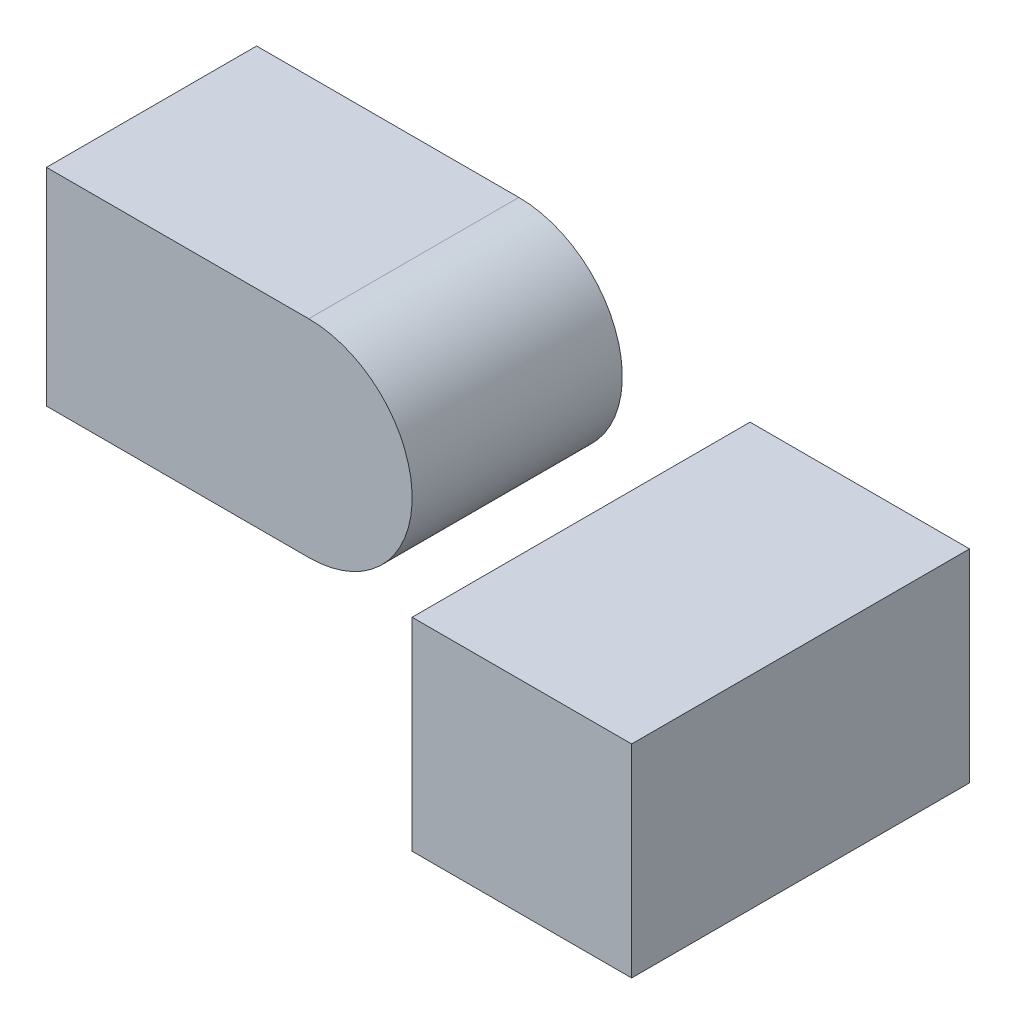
ISO-10303-21;
HEADER;
FILE_DESCRIPTION(('STEP AP214'),'2;1');
FILE_NAME('part.step','',(''),(''),'','','');
FILE_SCHEMA(('AUTOMOTIVE_DESIGN { 1 0 10303 214 1 1 1 1 }'));
ENDSEC;
DATA;
#1=APPLICATION_CONTEXT('core data for automotive mechanical design processes');
#2=APPLICATION_PROTOCOL_DEFINITION('international standard','automotive_design',2000,#1);
#3=PRODUCT_CONTEXT('',#1,'mechanical');
#4=PRODUCT('Part','Part','',(#3));
#5=PRODUCT_RELATED_PRODUCT_CATEGORY('part','',(#4));
#6=PRODUCT_DEFINITION_FORMATION('','',#4);
#7=PRODUCT_DEFINITION_CONTEXT('part definition',#1,'design');
#8=PRODUCT_DEFINITION('design','',#6,#7);
#9=PRODUCT_DEFINITION_SHAPE('','',#8);
#10=(LENGTH_UNIT() NAMED_UNIT(*) SI_UNIT(.MILLI.,.METRE.));
#11=(NAMED_UNIT(*) PLANE_ANGLE_UNIT() SI_UNIT($,.RADIAN.));
#12=(NAMED_UNIT(*) SI_UNIT($,.STERADIAN.) SOLID_ANGLE_UNIT());
#13=UNCERTAINTY_MEASURE_WITH_UNIT(LENGTH_MEASURE(1.E-05),#10,'distance_accuracy_value','');
#14=(GEOMETRIC_REPRESENTATION_CONTEXT(3) GLOBAL_UNCERTAINTY_ASSIGNED_CONTEXT((#13)) GLOBAL_UNIT_ASSIGNED_CONTEXT((#10,
#11,#12)) REPRESENTATION_CONTEXT('',''));
#15=CARTESIAN_POINT('',(0.,0.,0.));
#16=DIRECTION('',(0.,0.,1.));
#17=DIRECTION('',(1.,0.,0.));
#18=AXIS2_PLACEMENT_3D('',#15,#16,#17);
#19=CARTESIAN_POINT('',(88.7379145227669,0.,-31.));
#20=DIRECTION('',(-1.,0.,0.));
#21=DIRECTION('',(0.,0.,1.));
#22=AXIS2_PLACEMENT_3D('',#19,#20,#21);
#23=PLANE('',#22);
#24=DIRECTION('',(0.,-1.,0.));
#25=VECTOR('',#24,1.);
#26=CARTESIAN_POINT('',(88.7379145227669,0.,51.));
#27=LINE('',#26,#25);
#28=CARTESIAN_POINT('',(88.7379145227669,0.,51.));
#29=VERTEX_POINT('',#28);
#30=CARTESIAN_POINT('',(88.7379145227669,-49.1849191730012,51.));
#31=VERTEX_POINT('',#30);
#32=EDGE_CURVE('E107',#29,#31,#27,.T.);
#33=ORIENTED_EDGE('',*,*,#32,.F.);
#34=DIRECTION('',(0.,0.,1.));
#35=VECTOR('',#34,1.);
#36=CARTESIAN_POINT('',(88.7379145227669,0.,-31.));
#37=LINE('',#36,#35);
#38=CARTESIAN_POINT('',(88.7379145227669,0.,-31.));
#39=VERTEX_POINT('',#38);
#40=EDGE_CURVE('E12',#39,#29,#37,.T.);
#41=ORIENTED_EDGE('',*,*,#40,.F.);
#42=DIRECTION('',(0.,-1.,0.));
#43=VECTOR('',#42,1.);
#44=CARTESIAN_POINT('',(88.7379145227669,0.,-31.));
#45=LINE('',#44,#43);
#46=CARTESIAN_POINT('',(88.7379145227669,-49.1849191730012,-31.));
#47=VERTEX_POINT('',#46);
#48=EDGE_CURVE('E101',#39,#47,#45,.T.);
#49=ORIENTED_EDGE('',*,*,#48,.T.);
#50=DIRECTION('',(0.,0.,1.));
#51=VECTOR('',#50,1.);
#52=CARTESIAN_POINT('',(88.7379145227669,-49.1849191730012,-31.));
#53=LINE('',#52,#51);
#54=EDGE_CURVE('E46',#47,#31,#53,.T.);
#55=ORIENTED_EDGE('',*,*,#54,.T.);
#56=EDGE_LOOP('',(#33,#41,#49,#55));
#57=FACE_BOUND('',#56,.T.);
#58=ADVANCED_FACE('F43',(#57),#23,.T.);
#59=CARTESIAN_POINT('',(88.7379145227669,0.,-31.));
#60=DIRECTION('',(0.,1.,0.));
#61=DIRECTION('',(0.,0.,1.));
#62=AXIS2_PLACEMENT_3D('',#59,#60,#61);
#63=PLANE('',#62);
#64=DIRECTION('',(-1.,0.,0.));
#65=VECTOR('',#64,1.);
#66=CARTESIAN_POINT('',(88.7379145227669,0.,51.));
#67=LINE('',#66,#65);
#68=CARTESIAN_POINT('',(142.00653326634,0.,51.));
#69=VERTEX_POINT('',#68);
#70=EDGE_CURVE('E103',#69,#29,#67,.T.);
#71=ORIENTED_EDGE('',*,*,#70,.F.);
#72=DIRECTION('',(0.,0.,1.));
#73=VECTOR('',#72,1.);
#74=CARTESIAN_POINT('',(142.00653326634,0.,-31.));
#75=LINE('',#74,#73);
#76=CARTESIAN_POINT('',(142.00653326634,0.,-31.));
#77=VERTEX_POINT('',#76);
#78=EDGE_CURVE('E52',#77,#69,#75,.T.);
#79=ORIENTED_EDGE('',*,*,#78,.F.);
#80=DIRECTION('',(-1.,0.,0.));
#81=VECTOR('',#80,1.);
#82=CARTESIAN_POINT('',(88.7379145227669,0.,-31.));
#83=LINE('',#82,#81);
#84=EDGE_CURVE('E98',#77,#39,#83,.T.);
#85=ORIENTED_EDGE('',*,*,#84,.T.);
#86=ORIENTED_EDGE('',*,*,#40,.T.);
#87=EDGE_LOOP('',(#71,#79,#85,#86));
#88=FACE_BOUND('',#87,.T.);
#89=ADVANCED_FACE('F117',(#88),#63,.T.);
#90=CARTESIAN_POINT('',(142.00653326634,0.,-31.));
#91=DIRECTION('',(1.,0.,0.));
#92=DIRECTION('',(0.,0.,-1.));
#93=AXIS2_PLACEMENT_3D('',#90,#91,#92);
#94=PLANE('',#93);
#95=DIRECTION('',(0.,1.,0.));
#96=VECTOR('',#95,1.);
#97=CARTESIAN_POINT('',(142.00653326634,0.,51.));
#98=LINE('',#97,#96);
#99=CARTESIAN_POINT('',(142.00653326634,-49.1849191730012,51.));
#100=VERTEX_POINT('',#99);
#101=EDGE_CURVE('E93',#100,#69,#98,.T.);
#102=ORIENTED_EDGE('',*,*,#101,.F.);
#103=DIRECTION('',(0.,0.,1.));
#104=VECTOR('',#103,1.);
#105=CARTESIAN_POINT('',(142.00653326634,-49.1849191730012,-31.));
#106=LINE('',#105,#104);
#107=CARTESIAN_POINT('',(142.00653326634,-49.1849191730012,-31.));
#108=VERTEX_POINT('',#107);
#109=EDGE_CURVE('E88',#108,#100,#106,.T.);
#110=ORIENTED_EDGE('',*,*,#109,.F.);
#111=DIRECTION('',(0.,1.,0.));
#112=VECTOR('',#111,1.);
#113=CARTESIAN_POINT('',(142.00653326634,0.,-31.));
#114=LINE('',#113,#112);
#115=EDGE_CURVE('E91',#108,#77,#114,.T.);
#116=ORIENTED_EDGE('',*,*,#115,.T.);
#117=ORIENTED_EDGE('',*,*,#78,.T.);
#118=EDGE_LOOP('',(#102,#110,#116,#117));
#119=FACE_BOUND('',#118,.T.);
#120=ADVANCED_FACE('F90',(#119),#94,.T.);
#121=CARTESIAN_POINT('',(88.7379145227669,-49.1849191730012,-31.));
#122=DIRECTION('',(0.,-1.,0.));
#123=DIRECTION('',(0.,0.,-1.));
#124=AXIS2_PLACEMENT_3D('',#121,#122,#123);
#125=PLANE('',#124);
#126=DIRECTION('',(1.,0.,0.));
#127=VECTOR('',#126,1.);
#128=CARTESIAN_POINT('',(88.7379145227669,-49.1849191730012,51.));
#129=LINE('',#128,#127);
#130=EDGE_CURVE('E110',#31,#100,#129,.T.);
#131=ORIENTED_EDGE('',*,*,#130,.F.);
#132=ORIENTED_EDGE('',*,*,#54,.F.);
#133=DIRECTION('',(1.,0.,0.));
#134=VECTOR('',#133,1.);
#135=CARTESIAN_POINT('',(88.7379145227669,-49.1849191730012,-31.));
#136=LINE('',#135,#134);
#137=EDGE_CURVE('E97',#47,#108,#136,.T.);
#138=ORIENTED_EDGE('',*,*,#137,.T.);
#139=ORIENTED_EDGE('',*,*,#109,.T.);
#140=EDGE_LOOP('',(#131,#132,#138,#139));
#141=FACE_BOUND('',#140,.T.);
#142=ADVANCED_FACE('F100',(#141),#125,.T.);
#143=CARTESIAN_POINT('',(88.7379145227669,-49.1849191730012,-31.));
#144=DIRECTION('',(0.,0.,1.));
#145=DIRECTION('',(1.,0.,0.));
#146=AXIS2_PLACEMENT_3D('',#143,#144,#145);
#147=PLANE('',#146);
#148=ORIENTED_EDGE('',*,*,#48,.F.);
#149=ORIENTED_EDGE('',*,*,#84,.F.);
#150=ORIENTED_EDGE('',*,*,#115,.F.);
#151=ORIENTED_EDGE('',*,*,#137,.F.);
#152=EDGE_LOOP('',(#148,#149,#150,#151));
#153=FACE_BOUND('',#152,.T.);
#154=ADVANCED_FACE('F96',(#153),#147,.F.);
#155=CARTESIAN_POINT('',(88.7379145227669,-49.1849191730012,51.));
#156=DIRECTION('',(0.,0.,1.));
#157=DIRECTION('',(1.,0.,0.));
#158=AXIS2_PLACEMENT_3D('',#155,#156,#157);
#159=PLANE('',#158);
#160=ORIENTED_EDGE('',*,*,#32,.T.);
#161=ORIENTED_EDGE('',*,*,#130,.T.);
#162=ORIENTED_EDGE('',*,*,#101,.T.);
#163=ORIENTED_EDGE('',*,*,#70,.T.);
#164=EDGE_LOOP('',(#160,#161,#162,#163));
#165=FACE_BOUND('',#164,.T.);
#166=ADVANCED_FACE('F116',(#165),#159,.T.);
#167=CLOSED_SHELL('',(#58,#89,#120,#142,#154,#166));
#168=MANIFOLD_SOLID_BREP('B2',#167);
#169=CARTESIAN_POINT('',(63.6471336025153,25.0907809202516,51.));
#170=DIRECTION('',(0.,0.,-1.));
#171=DIRECTION('',(-1.,0.,0.));
#172=AXIS2_PLACEMENT_3D('',#169,#170,#171);
#173=CYLINDRICAL_SURFACE('',#172,25.0907809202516);
#174=DIRECTION('',(0.,0.,-1.));
#175=VECTOR('',#174,1.);
#176=CARTESIAN_POINT('',(63.6471336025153,50.1815618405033,51.));
#177=LINE('',#176,#175);
#178=CARTESIAN_POINT('',(63.6471336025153,50.1815618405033,51.));
#179=VERTEX_POINT('',#178);
#180=CARTESIAN_POINT('',(63.6471336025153,50.1815618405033,0.));
#181=VERTEX_POINT('',#180);
#182=EDGE_CURVE('E227',#179,#181,#177,.T.);
#183=ORIENTED_EDGE('',*,*,#182,.F.);
#184=CARTESIAN_POINT('',(63.6471336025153,25.0907809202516,51.));
#185=DIRECTION('',(0.,0.,-1.));
#186=DIRECTION('',(-1.,0.,0.));
#187=AXIS2_PLACEMENT_3D('',#184,#185,#186);
#188=CIRCLE('',#187,25.0907809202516);
#189=CARTESIAN_POINT('',(63.6471336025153,0.,51.));
#190=VERTEX_POINT('',#189);
#191=EDGE_CURVE('E174',#190,#179,#188,.F.);
#192=ORIENTED_EDGE('',*,*,#191,.F.);
#193=DIRECTION('',(0.,0.,-1.));
#194=VECTOR('',#193,1.);
#195=CARTESIAN_POINT('',(63.6471336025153,0.,51.));
#196=LINE('',#195,#194);
#197=CARTESIAN_POINT('',(63.6471336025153,0.,0.));
#198=VERTEX_POINT('',#197);
#199=EDGE_CURVE('E211',#198,#190,#196,.F.);
#200=ORIENTED_EDGE('',*,*,#199,.F.);
#201=CARTESIAN_POINT('',(63.6471336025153,25.0907809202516,0.));
#202=DIRECTION('',(0.,0.,-1.));
#203=DIRECTION('',(-1.,0.,0.));
#204=AXIS2_PLACEMENT_3D('',#201,#202,#203);
#205=CIRCLE('',#204,25.0907809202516);
#206=EDGE_CURVE('E41',#181,#198,#205,.T.);
#207=ORIENTED_EDGE('',*,*,#206,.F.);
#208=EDGE_LOOP('',(#183,#192,#200,#207));
#209=FACE_BOUND('',#208,.T.);
#210=ADVANCED_FACE('F167',(#209),#173,.T.);
#211=CARTESIAN_POINT('',(0.,0.,51.));
#212=DIRECTION('',(1.,0.,0.));
#213=DIRECTION('',(0.,0.,-1.));
#214=AXIS2_PLACEMENT_3D('',#211,#212,#213);
#215=PLANE('',#214);
#216=DIRECTION('',(0.,-1.,0.));
#217=VECTOR('',#216,1.);
#218=CARTESIAN_POINT('',(0.,0.,0.));
#219=LINE('',#218,#217);
#220=CARTESIAN_POINT('',(0.,50.1815618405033,0.));
#221=VERTEX_POINT('',#220);
#222=CARTESIAN_POINT('',(0.,0.,0.));
#223=VERTEX_POINT('',#222);
#224=EDGE_CURVE('E226',#221,#223,#219,.T.);
#225=ORIENTED_EDGE('',*,*,#224,.T.);
#226=DIRECTION('',(0.,0.,-1.));
#227=VECTOR('',#226,1.);
#228=CARTESIAN_POINT('',(0.,0.,51.));
#229=LINE('',#228,#227);
#230=CARTESIAN_POINT('',(0.,0.,51.));
#231=VERTEX_POINT('',#230);
#232=EDGE_CURVE('E209',#231,#223,#229,.T.);
#233=ORIENTED_EDGE('',*,*,#232,.F.);
#234=DIRECTION('',(0.,-1.,0.));
#235=VECTOR('',#234,1.);
#236=CARTESIAN_POINT('',(0.,0.,51.));
#237=LINE('',#236,#235);
#238=CARTESIAN_POINT('',(0.,50.1815618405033,51.));
#239=VERTEX_POINT('',#238);
#240=EDGE_CURVE('E214',#239,#231,#237,.T.);
#241=ORIENTED_EDGE('',*,*,#240,.F.);
#242=DIRECTION('',(0.,0.,-1.));
#243=VECTOR('',#242,1.);
#244=CARTESIAN_POINT('',(0.,50.1815618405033,51.));
#245=LINE('',#244,#243);
#246=EDGE_CURVE('E228',#239,#221,#245,.T.);
#247=ORIENTED_EDGE('',*,*,#246,.T.);
#248=EDGE_LOOP('',(#225,#233,#241,#247));
#249=FACE_BOUND('',#248,.T.);
#250=ADVANCED_FACE('F224',(#249),#215,.F.);
#251=CARTESIAN_POINT('',(0.,0.,51.));
#252=DIRECTION('',(0.,1.,0.));
#253=DIRECTION('',(0.,0.,1.));
#254=AXIS2_PLACEMENT_3D('',#251,#252,#253);
#255=PLANE('',#254);
#256=DIRECTION('',(1.,0.,0.));
#257=VECTOR('',#256,1.);
#258=CARTESIAN_POINT('',(0.,0.,0.));
#259=LINE('',#258,#257);
#260=EDGE_CURVE('E240',#223,#198,#259,.T.);
#261=ORIENTED_EDGE('',*,*,#260,.T.);
#262=ORIENTED_EDGE('',*,*,#199,.T.);
#263=DIRECTION('',(1.,0.,0.));
#264=VECTOR('',#263,1.);
#265=CARTESIAN_POINT('',(0.,0.,51.));
#266=LINE('',#265,#264);
#267=EDGE_CURVE('E204',#231,#190,#266,.T.);
#268=ORIENTED_EDGE('',*,*,#267,.F.);
#269=ORIENTED_EDGE('',*,*,#232,.T.);
#270=EDGE_LOOP('',(#261,#262,#268,#269));
#271=FACE_BOUND('',#270,.T.);
#272=ADVANCED_FACE('F207',(#271),#255,.F.);
#273=CARTESIAN_POINT('',(0.,50.1815618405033,51.));
#274=DIRECTION('',(0.,-1.,0.));
#275=DIRECTION('',(0.,0.,-1.));
#276=AXIS2_PLACEMENT_3D('',#273,#274,#275);
#277=PLANE('',#276);
#278=DIRECTION('',(-1.,0.,0.));
#279=VECTOR('',#278,1.);
#280=CARTESIAN_POINT('',(0.,50.1815618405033,51.));
#281=LINE('',#280,#279);
#282=EDGE_CURVE('E213',#179,#239,#281,.T.);
#283=ORIENTED_EDGE('',*,*,#282,.F.);
#284=ORIENTED_EDGE('',*,*,#182,.T.);
#285=DIRECTION('',(-1.,0.,0.));
#286=VECTOR('',#285,1.);
#287=CARTESIAN_POINT('',(0.,50.1815618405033,0.));
#288=LINE('',#287,#286);
#289=EDGE_CURVE('E222',#181,#221,#288,.T.);
#290=ORIENTED_EDGE('',*,*,#289,.T.);
#291=ORIENTED_EDGE('',*,*,#246,.F.);
#292=EDGE_LOOP('',(#283,#284,#290,#291));
#293=FACE_BOUND('',#292,.T.);
#294=ADVANCED_FACE('F236',(#293),#277,.F.);
#295=CARTESIAN_POINT('',(0.,50.1815618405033,51.));
#296=DIRECTION('',(0.,0.,-1.));
#297=DIRECTION('',(-1.,0.,0.));
#298=AXIS2_PLACEMENT_3D('',#295,#296,#297);
#299=PLANE('',#298);
#300=ORIENTED_EDGE('',*,*,#267,.T.);
#301=ORIENTED_EDGE('',*,*,#191,.T.);
#302=ORIENTED_EDGE('',*,*,#282,.T.);
#303=ORIENTED_EDGE('',*,*,#240,.T.);
#304=EDGE_LOOP('',(#300,#301,#302,#303));
#305=FACE_BOUND('',#304,.T.);
#306=ADVANCED_FACE('F217',(#305),#299,.F.);
#307=CARTESIAN_POINT('',(0.,50.1815618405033,0.));
#308=DIRECTION('',(0.,0.,-1.));
#309=DIRECTION('',(-1.,0.,0.));
#310=AXIS2_PLACEMENT_3D('',#307,#308,#309);
#311=PLANE('',#310);
#312=ORIENTED_EDGE('',*,*,#289,.F.);
#313=ORIENTED_EDGE('',*,*,#206,.T.);
#314=ORIENTED_EDGE('',*,*,#260,.F.);
#315=ORIENTED_EDGE('',*,*,#224,.F.);
#316=EDGE_LOOP('',(#312,#313,#314,#315));
#317=FACE_BOUND('',#316,.T.);
#318=ADVANCED_FACE('F241',(#317),#311,.T.);
#319=CLOSED_SHELL('',(#210,#250,#272,#294,#306,#318));
#320=MANIFOLD_SOLID_BREP('B6',#319);
#321=ADVANCED_BREP_SHAPE_REPRESENTATION('',(#18,#168,#320),#14);
#322=SHAPE_DEFINITION_REPRESENTATION(#9,#321);
ENDSEC;
END-ISO-10303-21;
